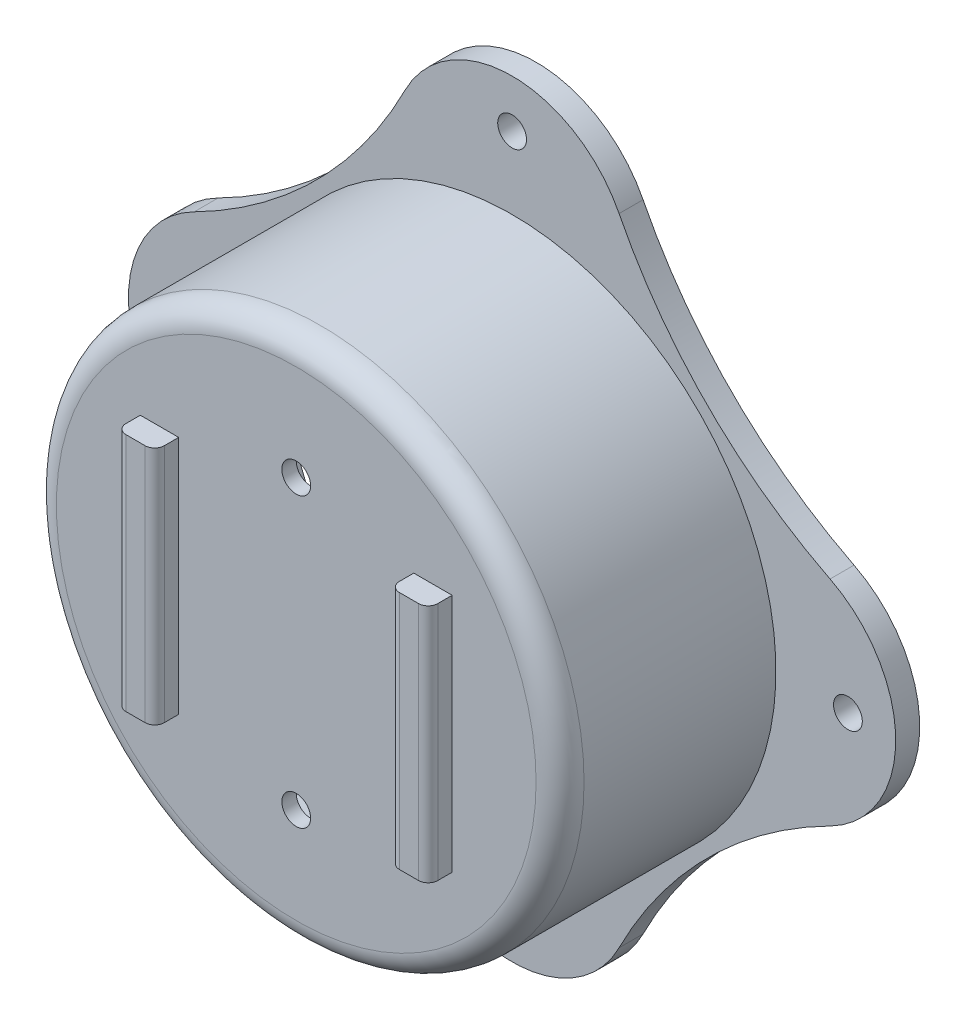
ISO-10303-21;
HEADER;
FILE_DESCRIPTION(('STEP AP214'),'2;1');
FILE_NAME('part.step','',(''),(''),'','','');
FILE_SCHEMA(('AUTOMOTIVE_DESIGN { 1 0 10303 214 1 1 1 1 }'));
ENDSEC;
DATA;
#1=APPLICATION_CONTEXT('core data for automotive mechanical design processes');
#2=APPLICATION_PROTOCOL_DEFINITION('international standard','automotive_design',2000,#1);
#3=PRODUCT_CONTEXT('',#1,'mechanical');
#4=PRODUCT('Part','Part','',(#3));
#5=PRODUCT_RELATED_PRODUCT_CATEGORY('part','',(#4));
#6=PRODUCT_DEFINITION_FORMATION('','',#4);
#7=PRODUCT_DEFINITION_CONTEXT('part definition',#1,'design');
#8=PRODUCT_DEFINITION('design','',#6,#7);
#9=PRODUCT_DEFINITION_SHAPE('','',#8);
#10=(LENGTH_UNIT() NAMED_UNIT(*) SI_UNIT(.MILLI.,.METRE.));
#11=(NAMED_UNIT(*) PLANE_ANGLE_UNIT() SI_UNIT($,.RADIAN.));
#12=(NAMED_UNIT(*) SI_UNIT($,.STERADIAN.) SOLID_ANGLE_UNIT());
#13=UNCERTAINTY_MEASURE_WITH_UNIT(LENGTH_MEASURE(1.E-05),#10,'distance_accuracy_value','');
#14=(GEOMETRIC_REPRESENTATION_CONTEXT(3) GLOBAL_UNCERTAINTY_ASSIGNED_CONTEXT((#13)) GLOBAL_UNIT_ASSIGNED_CONTEXT((#10,
#11,#12)) REPRESENTATION_CONTEXT('',''));
#15=CARTESIAN_POINT('',(0.,0.,0.));
#16=DIRECTION('',(0.,0.,1.));
#17=DIRECTION('',(1.,0.,0.));
#18=AXIS2_PLACEMENT_3D('',#15,#16,#17);
#19=CARTESIAN_POINT('',(0.,0.,50.));
#20=DIRECTION('',(0.,0.,-1.));
#21=DIRECTION('',(-1.,0.,0.));
#22=AXIS2_PLACEMENT_3D('',#19,#20,#21);
#23=CYLINDRICAL_SURFACE('',#22,55.);
#24=CARTESIAN_POINT('',(0.,0.,45.));
#25=DIRECTION('',(0.,0.,1.));
#26=DIRECTION('',(1.,0.,0.));
#27=AXIS2_PLACEMENT_3D('',#24,#25,#26);
#28=CIRCLE('',#27,55.);
#29=CARTESIAN_POINT('',(55.,0.,45.));
#30=VERTEX_POINT('',#29);
#31=EDGE_CURVE('E320',#30,#30,#28,.F.);
#32=ORIENTED_EDGE('',*,*,#31,.T.);
#33=EDGE_LOOP('',(#32));
#34=FACE_BOUND('',#33,.T.);
#35=CARTESIAN_POINT('',(0.,0.,5.));
#36=DIRECTION('',(0.,0.,-1.));
#37=DIRECTION('',(-1.,0.,0.));
#38=AXIS2_PLACEMENT_3D('',#35,#36,#37);
#39=CIRCLE('',#38,55.);
#40=CARTESIAN_POINT('',(-55.,0.,5.));
#41=VERTEX_POINT('',#40);
#42=EDGE_CURVE('E323',#41,#41,#39,.T.);
#43=ORIENTED_EDGE('',*,*,#42,.F.);
#44=EDGE_LOOP('',(#43));
#45=FACE_BOUND('',#44,.T.);
#46=ADVANCED_FACE('F36',(#34,#45),#23,.T.);
#47=CARTESIAN_POINT('',(0.,0.,50.));
#48=DIRECTION('',(0.,0.,1.));
#49=DIRECTION('',(1.,0.,0.));
#50=AXIS2_PLACEMENT_3D('',#47,#48,#49);
#51=PLANE('',#50);
#52=DIRECTION('',(0.,-1.,0.));
#53=VECTOR('',#52,1.);
#54=CARTESIAN_POINT('',(32.5,0.,50.));
#55=LINE('',#54,#53);
#56=CARTESIAN_POINT('',(32.5,25.,50.));
#57=VERTEX_POINT('',#56);
#58=CARTESIAN_POINT('',(32.5,-25.,50.));
#59=VERTEX_POINT('',#58);
#60=EDGE_CURVE('E190',#57,#59,#55,.T.);
#61=ORIENTED_EDGE('',*,*,#60,.T.);
#62=DIRECTION('',(1.,0.,0.));
#63=VECTOR('',#62,1.);
#64=CARTESIAN_POINT('',(0.,-25.,50.));
#65=LINE('',#64,#63);
#66=CARTESIAN_POINT('',(24.5,-25.,50.));
#67=VERTEX_POINT('',#66);
#68=EDGE_CURVE('E204',#67,#59,#65,.T.);
#69=ORIENTED_EDGE('',*,*,#68,.F.);
#70=DIRECTION('',(0.,-1.,0.));
#71=VECTOR('',#70,1.);
#72=CARTESIAN_POINT('',(24.5,0.,50.));
#73=LINE('',#72,#71);
#74=CARTESIAN_POINT('',(24.5,25.,50.));
#75=VERTEX_POINT('',#74);
#76=EDGE_CURVE('E202',#75,#67,#73,.T.);
#77=ORIENTED_EDGE('',*,*,#76,.F.);
#78=DIRECTION('',(1.,0.,0.));
#79=VECTOR('',#78,1.);
#80=CARTESIAN_POINT('',(0.,25.,50.));
#81=LINE('',#80,#79);
#82=EDGE_CURVE('E179',#75,#57,#81,.T.);
#83=ORIENTED_EDGE('',*,*,#82,.T.);
#84=EDGE_LOOP('',(#61,#69,#77,#83));
#85=FACE_BOUND('',#84,.T.);
#86=DIRECTION('',(0.,-1.,0.));
#87=VECTOR('',#86,1.);
#88=CARTESIAN_POINT('',(-24.5,0.,50.));
#89=LINE('',#88,#87);
#90=CARTESIAN_POINT('',(-24.5,25.,50.));
#91=VERTEX_POINT('',#90);
#92=CARTESIAN_POINT('',(-24.5,-25.,50.));
#93=VERTEX_POINT('',#92);
#94=EDGE_CURVE('E186',#91,#93,#89,.T.);
#95=ORIENTED_EDGE('',*,*,#94,.T.);
#96=DIRECTION('',(-1.,0.,0.));
#97=VECTOR('',#96,1.);
#98=CARTESIAN_POINT('',(0.,-25.,50.));
#99=LINE('',#98,#97);
#100=CARTESIAN_POINT('',(-32.5,-25.,50.));
#101=VERTEX_POINT('',#100);
#102=EDGE_CURVE('E218',#93,#101,#99,.T.);
#103=ORIENTED_EDGE('',*,*,#102,.T.);
#104=DIRECTION('',(0.,-1.,0.));
#105=VECTOR('',#104,1.);
#106=CARTESIAN_POINT('',(-32.5,0.,50.));
#107=LINE('',#106,#105);
#108=CARTESIAN_POINT('',(-32.5,25.,50.));
#109=VERTEX_POINT('',#108);
#110=EDGE_CURVE('E227',#109,#101,#107,.T.);
#111=ORIENTED_EDGE('',*,*,#110,.F.);
#112=DIRECTION('',(-1.,0.,0.));
#113=VECTOR('',#112,1.);
#114=CARTESIAN_POINT('',(0.,25.,50.));
#115=LINE('',#114,#113);
#116=EDGE_CURVE('E224',#91,#109,#115,.T.);
#117=ORIENTED_EDGE('',*,*,#116,.F.);
#118=EDGE_LOOP('',(#95,#103,#111,#117));
#119=FACE_BOUND('',#118,.T.);
#120=CARTESIAN_POINT('',(0.,30.,50.));
#121=DIRECTION('',(0.,0.,1.));
#122=DIRECTION('',(1.,0.,0.));
#123=AXIS2_PLACEMENT_3D('',#120,#121,#122);
#124=CIRCLE('',#123,3.);
#125=CARTESIAN_POINT('',(3.,30.,50.));
#126=VERTEX_POINT('',#125);
#127=EDGE_CURVE('E240',#126,#126,#124,.T.);
#128=ORIENTED_EDGE('',*,*,#127,.F.);
#129=EDGE_LOOP('',(#128));
#130=FACE_BOUND('',#129,.T.);
#131=CARTESIAN_POINT('',(0.,-30.,50.));
#132=DIRECTION('',(0.,0.,1.));
#133=DIRECTION('',(1.,0.,0.));
#134=AXIS2_PLACEMENT_3D('',#131,#132,#133);
#135=CIRCLE('',#134,3.);
#136=CARTESIAN_POINT('',(3.,-30.,50.));
#137=VERTEX_POINT('',#136);
#138=EDGE_CURVE('E239',#137,#137,#135,.T.);
#139=ORIENTED_EDGE('',*,*,#138,.F.);
#140=EDGE_LOOP('',(#139));
#141=FACE_BOUND('',#140,.T.);
#142=CARTESIAN_POINT('',(0.,0.,50.));
#143=DIRECTION('',(0.,0.,1.));
#144=DIRECTION('',(1.,0.,0.));
#145=AXIS2_PLACEMENT_3D('',#142,#143,#144);
#146=CIRCLE('',#145,50.);
#147=CARTESIAN_POINT('',(50.,0.,50.));
#148=VERTEX_POINT('',#147);
#149=EDGE_CURVE('E304',#148,#148,#146,.T.);
#150=ORIENTED_EDGE('',*,*,#149,.T.);
#151=EDGE_LOOP('',(#150));
#152=FACE_BOUND('',#151,.T.);
#153=ADVANCED_FACE('F199',(#85,#119,#130,#141,#152),#51,.T.);
#154=CARTESIAN_POINT('',(0.,0.,45.));
#155=DIRECTION('',(0.,0.,1.));
#156=DIRECTION('',(1.,0.,0.));
#157=AXIS2_PLACEMENT_3D('',#154,#155,#156);
#158=TOROIDAL_SURFACE('',#157,50.,5.);
#159=ORIENTED_EDGE('',*,*,#31,.F.);
#160=EDGE_LOOP('',(#159));
#161=FACE_BOUND('',#160,.T.);
#162=ORIENTED_EDGE('',*,*,#149,.F.);
#163=EDGE_LOOP('',(#162));
#164=FACE_BOUND('',#163,.T.);
#165=ADVANCED_FACE('F382',(#161,#164),#158,.T.);
#166=CARTESIAN_POINT('',(-111.488826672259,111.526227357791,5.));
#167=DIRECTION('',(0.,0.,-1.));
#168=DIRECTION('',(-1.,0.,0.));
#169=AXIS2_PLACEMENT_3D('',#166,#167,#168);
#170=CYLINDRICAL_SURFACE('',#169,99.9998914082);
#171=CARTESIAN_POINT('',(-111.488826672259,111.526227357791,0.));
#172=DIRECTION('',(0.,0.,1.));
#173=DIRECTION('',(-1.,0.,0.));
#174=AXIS2_PLACEMENT_3D('',#171,#172,#173);
#175=CIRCLE('',#174,99.9998914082);
#176=CARTESIAN_POINT('',(-66.2765184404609,22.3307932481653,0.));
#177=VERTEX_POINT('',#176);
#178=CARTESIAN_POINT('',(-22.2977847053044,66.3052552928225,0.));
#179=VERTEX_POINT('',#178);
#180=EDGE_CURVE('E249',#177,#179,#175,.T.);
#181=ORIENTED_EDGE('',*,*,#180,.F.);
#182=DIRECTION('',(0.,0.,-1.));
#183=VECTOR('',#182,1.);
#184=CARTESIAN_POINT('',(-66.2765184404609,22.3307932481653,5.));
#185=LINE('',#184,#183);
#186=CARTESIAN_POINT('',(-66.2765184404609,22.3307932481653,5.));
#187=VERTEX_POINT('',#186);
#188=EDGE_CURVE('E302',#187,#177,#185,.T.);
#189=ORIENTED_EDGE('',*,*,#188,.F.);
#190=CARTESIAN_POINT('',(-111.488826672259,111.526227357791,5.));
#191=DIRECTION('',(0.,0.,1.));
#192=DIRECTION('',(-1.,0.,0.));
#193=AXIS2_PLACEMENT_3D('',#190,#191,#192);
#194=CIRCLE('',#193,99.9998914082);
#195=CARTESIAN_POINT('',(-22.2977847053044,66.3052552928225,5.));
#196=VERTEX_POINT('',#195);
#197=EDGE_CURVE('E254',#187,#196,#194,.T.);
#198=ORIENTED_EDGE('',*,*,#197,.T.);
#199=DIRECTION('',(0.,0.,-1.));
#200=VECTOR('',#199,1.);
#201=CARTESIAN_POINT('',(-22.2977847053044,66.3052552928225,5.));
#202=LINE('',#201,#200);
#203=EDGE_CURVE('E279',#196,#179,#202,.T.);
#204=ORIENTED_EDGE('',*,*,#203,.T.);
#205=EDGE_LOOP('',(#181,#189,#198,#204));
#206=FACE_BOUND('',#205,.T.);
#207=ADVANCED_FACE('F391',(#206),#170,.F.);
#208=CARTESIAN_POINT('',(-54.9734291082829,0.0319105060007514,5.));
#209=DIRECTION('',(0.,0.,-1.));
#210=DIRECTION('',(-1.,0.,0.));
#211=AXIS2_PLACEMENT_3D('',#208,#209,#210);
#212=CYLINDRICAL_SURFACE('',#211,24.9999999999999);
#213=CARTESIAN_POINT('',(-54.9734291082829,0.0319105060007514,0.));
#214=DIRECTION('',(0.,0.,-1.));
#215=DIRECTION('',(-1.,0.,0.));
#216=AXIS2_PLACEMENT_3D('',#213,#214,#215);
#217=CIRCLE('',#216,24.9999999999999);
#218=CARTESIAN_POINT('',(-66.2786844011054,-22.2658741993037,0.));
#219=VERTEX_POINT('',#218);
#220=EDGE_CURVE('E258',#219,#177,#217,.T.);
#221=ORIENTED_EDGE('',*,*,#220,.F.);
#222=DIRECTION('',(0.,0.,-1.));
#223=VECTOR('',#222,1.);
#224=CARTESIAN_POINT('',(-66.2786844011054,-22.2658741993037,5.));
#225=LINE('',#224,#223);
#226=CARTESIAN_POINT('',(-66.2786844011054,-22.2658741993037,5.));
#227=VERTEX_POINT('',#226);
#228=EDGE_CURVE('E305',#227,#219,#225,.T.);
#229=ORIENTED_EDGE('',*,*,#228,.F.);
#230=CARTESIAN_POINT('',(-54.9734291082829,0.0319105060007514,5.));
#231=DIRECTION('',(0.,0.,-1.));
#232=DIRECTION('',(-1.,0.,0.));
#233=AXIS2_PLACEMENT_3D('',#230,#231,#232);
#234=CIRCLE('',#233,24.9999999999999);
#235=EDGE_CURVE('E276',#227,#187,#234,.T.);
#236=ORIENTED_EDGE('',*,*,#235,.T.);
#237=ORIENTED_EDGE('',*,*,#188,.T.);
#238=EDGE_LOOP('',(#221,#229,#236,#237));
#239=FACE_BOUND('',#238,.T.);
#240=ADVANCED_FACE('F397',(#239),#212,.T.);
#241=CARTESIAN_POINT('',(-111.499656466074,-111.456916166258,5.));
#242=DIRECTION('',(0.,0.,-1.));
#243=DIRECTION('',(-1.,0.,0.));
#244=AXIS2_PLACEMENT_3D('',#241,#242,#243);
#245=CYLINDRICAL_SURFACE('',#244,99.9998914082);
#246=CARTESIAN_POINT('',(-111.499656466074,-111.456916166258,0.));
#247=DIRECTION('',(0.,0.,1.));
#248=DIRECTION('',(-1.,0.,0.));
#249=AXIS2_PLACEMENT_3D('',#246,#247,#248);
#250=CIRCLE('',#249,99.9998914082);
#251=CARTESIAN_POINT('',(-22.3042223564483,-66.2446079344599,0.));
#252=VERTEX_POINT('',#251);
#253=EDGE_CURVE('E297',#252,#219,#250,.T.);
#254=ORIENTED_EDGE('',*,*,#253,.F.);
#255=DIRECTION('',(0.,0.,-1.));
#256=VECTOR('',#255,1.);
#257=CARTESIAN_POINT('',(-22.3042223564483,-66.2446079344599,5.));
#258=LINE('',#257,#256);
#259=CARTESIAN_POINT('',(-22.3042223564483,-66.2446079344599,5.));
#260=VERTEX_POINT('',#259);
#261=EDGE_CURVE('E307',#260,#252,#258,.T.);
#262=ORIENTED_EDGE('',*,*,#261,.F.);
#263=CARTESIAN_POINT('',(-111.499656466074,-111.456916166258,5.));
#264=DIRECTION('',(0.,0.,1.));
#265=DIRECTION('',(-1.,0.,0.));
#266=AXIS2_PLACEMENT_3D('',#263,#264,#265);
#267=CIRCLE('',#266,99.9998914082);
#268=EDGE_CURVE('E273',#260,#227,#267,.T.);
#269=ORIENTED_EDGE('',*,*,#268,.T.);
#270=ORIENTED_EDGE('',*,*,#228,.T.);
#271=EDGE_LOOP('',(#254,#262,#269,#270));
#272=FACE_BOUND('',#271,.T.);
#273=ADVANCED_FACE('F434',(#272),#245,.F.);
#274=CARTESIAN_POINT('',(-0.00533961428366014,-54.9415186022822,5.));
#275=DIRECTION('',(0.,0.,-1.));
#276=DIRECTION('',(-1.,0.,0.));
#277=AXIS2_PLACEMENT_3D('',#274,#275,#276);
#278=CYLINDRICAL_SURFACE('',#277,25.0000000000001);
#279=CARTESIAN_POINT('',(-0.00533961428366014,-54.9415186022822,0.));
#280=DIRECTION('',(0.,0.,-1.));
#281=DIRECTION('',(-1.,0.,0.));
#282=AXIS2_PLACEMENT_3D('',#279,#280,#281);
#283=CIRCLE('',#282,25.0000000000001);
#284=CARTESIAN_POINT('',(22.2924450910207,-66.2467738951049,0.));
#285=VERTEX_POINT('',#284);
#286=EDGE_CURVE('E294',#285,#252,#283,.T.);
#287=ORIENTED_EDGE('',*,*,#286,.F.);
#288=DIRECTION('',(0.,0.,-1.));
#289=VECTOR('',#288,1.);
#290=CARTESIAN_POINT('',(22.2924450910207,-66.2467738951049,5.));
#291=LINE('',#290,#289);
#292=CARTESIAN_POINT('',(22.2924450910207,-66.2467738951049,5.));
#293=VERTEX_POINT('',#292);
#294=EDGE_CURVE('E309',#293,#285,#291,.T.);
#295=ORIENTED_EDGE('',*,*,#294,.F.);
#296=CARTESIAN_POINT('',(-0.00533961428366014,-54.9415186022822,5.));
#297=DIRECTION('',(0.,0.,-1.));
#298=DIRECTION('',(-1.,0.,0.));
#299=AXIS2_PLACEMENT_3D('',#296,#297,#298);
#300=CIRCLE('',#299,25.0000000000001);
#301=EDGE_CURVE('E270',#293,#260,#300,.T.);
#302=ORIENTED_EDGE('',*,*,#301,.T.);
#303=ORIENTED_EDGE('',*,*,#261,.T.);
#304=EDGE_LOOP('',(#287,#295,#302,#303));
#305=FACE_BOUND('',#304,.T.);
#306=ADVANCED_FACE('F430',(#305),#278,.T.);
#307=CARTESIAN_POINT('',(111.483487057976,-111.467745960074,5.));
#308=DIRECTION('',(0.,0.,-1.));
#309=DIRECTION('',(-1.,0.,0.));
#310=AXIS2_PLACEMENT_3D('',#307,#308,#309);
#311=CYLINDRICAL_SURFACE('',#310,99.9998914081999);
#312=CARTESIAN_POINT('',(111.483487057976,-111.467745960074,0.));
#313=DIRECTION('',(0.,0.,1.));
#314=DIRECTION('',(-1.,0.,0.));
#315=AXIS2_PLACEMENT_3D('',#312,#313,#314);
#316=CIRCLE('',#315,99.9998914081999);
#317=CARTESIAN_POINT('',(66.2711788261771,-22.2723118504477,0.));
#318=VERTEX_POINT('',#317);
#319=EDGE_CURVE('E291',#318,#285,#316,.T.);
#320=ORIENTED_EDGE('',*,*,#319,.F.);
#321=DIRECTION('',(0.,0.,-1.));
#322=VECTOR('',#321,1.);
#323=CARTESIAN_POINT('',(66.2711788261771,-22.2723118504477,5.));
#324=LINE('',#323,#322);
#325=CARTESIAN_POINT('',(66.2711788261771,-22.2723118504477,5.));
#326=VERTEX_POINT('',#325);
#327=EDGE_CURVE('E311',#326,#318,#324,.T.);
#328=ORIENTED_EDGE('',*,*,#327,.F.);
#329=CARTESIAN_POINT('',(111.483487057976,-111.467745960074,5.));
#330=DIRECTION('',(0.,0.,1.));
#331=DIRECTION('',(-1.,0.,0.));
#332=AXIS2_PLACEMENT_3D('',#329,#330,#331);
#333=CIRCLE('',#332,99.9998914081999);
#334=EDGE_CURVE('E267',#326,#293,#333,.T.);
#335=ORIENTED_EDGE('',*,*,#334,.T.);
#336=ORIENTED_EDGE('',*,*,#294,.T.);
#337=EDGE_LOOP('',(#320,#328,#335,#336));
#338=FACE_BOUND('',#337,.T.);
#339=ADVANCED_FACE('F426',(#338),#311,.F.);
#340=CARTESIAN_POINT('',(54.9680894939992,0.026570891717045,5.));
#341=DIRECTION('',(0.,0.,-1.));
#342=DIRECTION('',(-1.,0.,0.));
#343=AXIS2_PLACEMENT_3D('',#340,#341,#342);
#344=CYLINDRICAL_SURFACE('',#343,25.);
#345=CARTESIAN_POINT('',(54.9680894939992,0.026570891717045,0.));
#346=DIRECTION('',(0.,0.,-1.));
#347=DIRECTION('',(-1.,0.,0.));
#348=AXIS2_PLACEMENT_3D('',#345,#346,#347);
#349=CIRCLE('',#348,25.);
#350=CARTESIAN_POINT('',(66.2733447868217,22.3243555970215,0.));
#351=VERTEX_POINT('',#350);
#352=EDGE_CURVE('E288',#351,#318,#349,.T.);
#353=ORIENTED_EDGE('',*,*,#352,.F.);
#354=DIRECTION('',(0.,0.,-1.));
#355=VECTOR('',#354,1.);
#356=CARTESIAN_POINT('',(66.2733447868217,22.3243555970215,5.));
#357=LINE('',#356,#355);
#358=CARTESIAN_POINT('',(66.2733447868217,22.3243555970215,5.));
#359=VERTEX_POINT('',#358);
#360=EDGE_CURVE('E313',#359,#351,#357,.T.);
#361=ORIENTED_EDGE('',*,*,#360,.F.);
#362=CARTESIAN_POINT('',(54.9680894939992,0.026570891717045,5.));
#363=DIRECTION('',(0.,0.,-1.));
#364=DIRECTION('',(-1.,0.,0.));
#365=AXIS2_PLACEMENT_3D('',#362,#363,#364);
#366=CIRCLE('',#365,25.);
#367=EDGE_CURVE('E264',#359,#326,#366,.T.);
#368=ORIENTED_EDGE('',*,*,#367,.T.);
#369=ORIENTED_EDGE('',*,*,#327,.T.);
#370=EDGE_LOOP('',(#353,#361,#368,#369));
#371=FACE_BOUND('',#370,.T.);
#372=ADVANCED_FACE('F422',(#371),#344,.T.);
#373=CARTESIAN_POINT('',(111.494316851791,111.515397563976,5.));
#374=DIRECTION('',(0.,0.,-1.));
#375=DIRECTION('',(-1.,0.,0.));
#376=AXIS2_PLACEMENT_3D('',#373,#374,#375);
#377=CYLINDRICAL_SURFACE('',#376,99.9998914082);
#378=CARTESIAN_POINT('',(111.494316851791,111.515397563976,0.));
#379=DIRECTION('',(0.,0.,1.));
#380=DIRECTION('',(-1.,0.,0.));
#381=AXIS2_PLACEMENT_3D('',#378,#379,#380);
#382=CIRCLE('',#381,99.9998914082);
#383=CARTESIAN_POINT('',(22.2988827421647,66.3030893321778,0.));
#384=VERTEX_POINT('',#383);
#385=EDGE_CURVE('E285',#384,#351,#382,.T.);
#386=ORIENTED_EDGE('',*,*,#385,.F.);
#387=DIRECTION('',(0.,0.,-1.));
#388=VECTOR('',#387,1.);
#389=CARTESIAN_POINT('',(22.2988827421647,66.3030893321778,5.));
#390=LINE('',#389,#388);
#391=CARTESIAN_POINT('',(22.2988827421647,66.3030893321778,5.));
#392=VERTEX_POINT('',#391);
#393=EDGE_CURVE('E315',#392,#384,#390,.T.);
#394=ORIENTED_EDGE('',*,*,#393,.F.);
#395=CARTESIAN_POINT('',(111.494316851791,111.515397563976,5.));
#396=DIRECTION('',(0.,0.,1.));
#397=DIRECTION('',(-1.,0.,0.));
#398=AXIS2_PLACEMENT_3D('',#395,#396,#397);
#399=CIRCLE('',#398,99.9998914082);
#400=EDGE_CURVE('E261',#392,#359,#399,.T.);
#401=ORIENTED_EDGE('',*,*,#400,.T.);
#402=ORIENTED_EDGE('',*,*,#360,.T.);
#403=EDGE_LOOP('',(#386,#394,#401,#402));
#404=FACE_BOUND('',#403,.T.);
#405=ADVANCED_FACE('F418',(#404),#377,.F.);
#406=CARTESIAN_POINT('',(0.,55.,5.));
#407=DIRECTION('',(0.,0.,-1.));
#408=DIRECTION('',(-1.,0.,0.));
#409=AXIS2_PLACEMENT_3D('',#406,#407,#408);
#410=CYLINDRICAL_SURFACE('',#409,25.);
#411=CARTESIAN_POINT('',(0.,55.,0.));
#412=DIRECTION('',(0.,0.,-1.));
#413=DIRECTION('',(-1.,0.,0.));
#414=AXIS2_PLACEMENT_3D('',#411,#412,#413);
#415=CIRCLE('',#414,25.);
#416=EDGE_CURVE('E282',#179,#384,#415,.T.);
#417=ORIENTED_EDGE('',*,*,#416,.F.);
#418=ORIENTED_EDGE('',*,*,#203,.F.);
#419=CARTESIAN_POINT('',(0.,55.,5.));
#420=DIRECTION('',(0.,0.,-1.));
#421=DIRECTION('',(-1.,0.,0.));
#422=AXIS2_PLACEMENT_3D('',#419,#420,#421);
#423=CIRCLE('',#422,25.);
#424=EDGE_CURVE('E257',#196,#392,#423,.T.);
#425=ORIENTED_EDGE('',*,*,#424,.T.);
#426=ORIENTED_EDGE('',*,*,#393,.T.);
#427=EDGE_LOOP('',(#417,#418,#425,#426));
#428=FACE_BOUND('',#427,.T.);
#429=ADVANCED_FACE('F415',(#428),#410,.T.);
#430=CARTESIAN_POINT('',(-83.231127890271,55.7790689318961,5.));
#431=DIRECTION('',(0.,0.,-1.));
#432=DIRECTION('',(-1.,0.,0.));
#433=AXIS2_PLACEMENT_3D('',#430,#431,#432);
#434=PLANE('',#433);
#435=CARTESIAN_POINT('',(70.,0.,5.));
#436=DIRECTION('',(0.,0.,1.));
#437=DIRECTION('',(1.,0.,0.));
#438=AXIS2_PLACEMENT_3D('',#435,#436,#437);
#439=CIRCLE('',#438,2.99999999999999);
#440=CARTESIAN_POINT('',(73.,0.,5.));
#441=VERTEX_POINT('',#440);
#442=EDGE_CURVE('E509',#441,#441,#439,.T.);
#443=ORIENTED_EDGE('',*,*,#442,.F.);
#444=EDGE_LOOP('',(#443));
#445=FACE_BOUND('',#444,.T.);
#446=CARTESIAN_POINT('',(-2.44403693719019E-13,-70.,5.));
#447=DIRECTION('',(0.,0.,1.));
#448=DIRECTION('',(1.,0.,0.));
#449=AXIS2_PLACEMENT_3D('',#446,#447,#448);
#450=CIRCLE('',#449,2.99999999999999);
#451=CARTESIAN_POINT('',(2.99999999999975,-70.,5.));
#452=VERTEX_POINT('',#451);
#453=EDGE_CURVE('E514',#452,#452,#450,.T.);
#454=ORIENTED_EDGE('',*,*,#453,.F.);
#455=EDGE_LOOP('',(#454));
#456=FACE_BOUND('',#455,.T.);
#457=CARTESIAN_POINT('',(-70.,4.88807387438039E-13,5.));
#458=DIRECTION('',(0.,0.,1.));
#459=DIRECTION('',(1.,0.,0.));
#460=AXIS2_PLACEMENT_3D('',#457,#458,#459);
#461=CIRCLE('',#460,2.99999999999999);
#462=CARTESIAN_POINT('',(-67.,4.88807387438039E-13,5.));
#463=VERTEX_POINT('',#462);
#464=EDGE_CURVE('E522',#463,#463,#461,.T.);
#465=ORIENTED_EDGE('',*,*,#464,.F.);
#466=EDGE_LOOP('',(#465));
#467=FACE_BOUND('',#466,.T.);
#468=CARTESIAN_POINT('',(7.33211081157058E-13,70.,5.));
#469=DIRECTION('',(0.,0.,1.));
#470=DIRECTION('',(1.,0.,0.));
#471=AXIS2_PLACEMENT_3D('',#468,#469,#470);
#472=CIRCLE('',#471,3.);
#473=CARTESIAN_POINT('',(3.00000000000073,70.,5.));
#474=VERTEX_POINT('',#473);
#475=EDGE_CURVE('E528',#474,#474,#472,.T.);
#476=ORIENTED_EDGE('',*,*,#475,.F.);
#477=EDGE_LOOP('',(#476));
#478=FACE_BOUND('',#477,.T.);
#479=ORIENTED_EDGE('',*,*,#42,.T.);
#480=EDGE_LOOP('',(#479));
#481=FACE_BOUND('',#480,.T.);
#482=ORIENTED_EDGE('',*,*,#197,.F.);
#483=ORIENTED_EDGE('',*,*,#235,.F.);
#484=ORIENTED_EDGE('',*,*,#268,.F.);
#485=ORIENTED_EDGE('',*,*,#301,.F.);
#486=ORIENTED_EDGE('',*,*,#334,.F.);
#487=ORIENTED_EDGE('',*,*,#367,.F.);
#488=ORIENTED_EDGE('',*,*,#400,.F.);
#489=ORIENTED_EDGE('',*,*,#424,.F.);
#490=EDGE_LOOP('',(#482,#483,#484,#485,#486,#487,#488,#489));
#491=FACE_BOUND('',#490,.T.);
#492=ADVANCED_FACE('F412',(#445,#456,#467,#478,#481,#491),#434,.F.);
#493=CARTESIAN_POINT('',(0.,0.,0.));
#494=DIRECTION('',(0.,0.,1.));
#495=DIRECTION('',(1.,0.,0.));
#496=AXIS2_PLACEMENT_3D('',#493,#494,#495);
#497=PLANE('',#496);
#498=CARTESIAN_POINT('',(70.,0.,0.));
#499=DIRECTION('',(0.,0.,1.));
#500=DIRECTION('',(1.,0.,0.));
#501=AXIS2_PLACEMENT_3D('',#498,#499,#500);
#502=CIRCLE('',#501,2.99999999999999);
#503=CARTESIAN_POINT('',(73.,0.,0.));
#504=VERTEX_POINT('',#503);
#505=EDGE_CURVE('E197',#504,#504,#502,.T.);
#506=ORIENTED_EDGE('',*,*,#505,.T.);
#507=EDGE_LOOP('',(#506));
#508=FACE_BOUND('',#507,.T.);
#509=CARTESIAN_POINT('',(-2.44403693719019E-13,-70.,0.));
#510=DIRECTION('',(0.,0.,1.));
#511=DIRECTION('',(1.,0.,0.));
#512=AXIS2_PLACEMENT_3D('',#509,#510,#511);
#513=CIRCLE('',#512,2.99999999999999);
#514=CARTESIAN_POINT('',(2.99999999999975,-70.,0.));
#515=VERTEX_POINT('',#514);
#516=EDGE_CURVE('E510',#515,#515,#513,.T.);
#517=ORIENTED_EDGE('',*,*,#516,.T.);
#518=EDGE_LOOP('',(#517));
#519=FACE_BOUND('',#518,.T.);
#520=CARTESIAN_POINT('',(-70.,4.88807387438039E-13,0.));
#521=DIRECTION('',(0.,0.,1.));
#522=DIRECTION('',(1.,0.,0.));
#523=AXIS2_PLACEMENT_3D('',#520,#521,#522);
#524=CIRCLE('',#523,2.99999999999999);
#525=CARTESIAN_POINT('',(-67.,4.88807387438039E-13,0.));
#526=VERTEX_POINT('',#525);
#527=EDGE_CURVE('E519',#526,#526,#524,.T.);
#528=ORIENTED_EDGE('',*,*,#527,.T.);
#529=EDGE_LOOP('',(#528));
#530=FACE_BOUND('',#529,.T.);
#531=CARTESIAN_POINT('',(7.33211081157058E-13,70.,0.));
#532=DIRECTION('',(0.,0.,1.));
#533=DIRECTION('',(1.,0.,0.));
#534=AXIS2_PLACEMENT_3D('',#531,#532,#533);
#535=CIRCLE('',#534,3.);
#536=CARTESIAN_POINT('',(3.00000000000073,70.,0.));
#537=VERTEX_POINT('',#536);
#538=EDGE_CURVE('E525',#537,#537,#535,.T.);
#539=ORIENTED_EDGE('',*,*,#538,.T.);
#540=EDGE_LOOP('',(#539));
#541=FACE_BOUND('',#540,.T.);
#542=CARTESIAN_POINT('',(0.,0.,0.));
#543=DIRECTION('',(0.,0.,-1.));
#544=DIRECTION('',(-1.,0.,0.));
#545=AXIS2_PLACEMENT_3D('',#542,#543,#544);
#546=CIRCLE('',#545,52.);
#547=CARTESIAN_POINT('',(-52.,0.,0.));
#548=VERTEX_POINT('',#547);
#549=EDGE_CURVE('E250',#548,#548,#546,.T.);
#550=ORIENTED_EDGE('',*,*,#549,.F.);
#551=EDGE_LOOP('',(#550));
#552=FACE_BOUND('',#551,.T.);
#553=ORIENTED_EDGE('',*,*,#180,.T.);
#554=ORIENTED_EDGE('',*,*,#416,.T.);
#555=ORIENTED_EDGE('',*,*,#385,.T.);
#556=ORIENTED_EDGE('',*,*,#352,.T.);
#557=ORIENTED_EDGE('',*,*,#319,.T.);
#558=ORIENTED_EDGE('',*,*,#286,.T.);
#559=ORIENTED_EDGE('',*,*,#253,.T.);
#560=ORIENTED_EDGE('',*,*,#220,.T.);
#561=EDGE_LOOP('',(#553,#554,#555,#556,#557,#558,#559,#560));
#562=FACE_BOUND('',#561,.T.);
#563=ADVANCED_FACE('F409',(#508,#519,#530,#541,#552,#562),#497,.F.);
#564=CARTESIAN_POINT('',(0.,0.,47.));
#565=DIRECTION('',(0.,0.,-1.));
#566=DIRECTION('',(-1.,0.,0.));
#567=AXIS2_PLACEMENT_3D('',#564,#565,#566);
#568=CYLINDRICAL_SURFACE('',#567,52.);
#569=CARTESIAN_POINT('',(0.,0.,47.));
#570=DIRECTION('',(0.,0.,-1.));
#571=DIRECTION('',(-1.,0.,0.));
#572=AXIS2_PLACEMENT_3D('',#569,#570,#571);
#573=CIRCLE('',#572,52.);
#574=CARTESIAN_POINT('',(-52.,0.,47.));
#575=VERTEX_POINT('',#574);
#576=EDGE_CURVE('E246',#575,#575,#573,.T.);
#577=ORIENTED_EDGE('',*,*,#576,.F.);
#578=EDGE_LOOP('',(#577));
#579=FACE_BOUND('',#578,.T.);
#580=ORIENTED_EDGE('',*,*,#549,.T.);
#581=EDGE_LOOP('',(#580));
#582=FACE_BOUND('',#581,.T.);
#583=ADVANCED_FACE('F411',(#579,#582),#568,.F.);
#584=CARTESIAN_POINT('',(0.,0.,47.));
#585=DIRECTION('',(0.,0.,-1.));
#586=DIRECTION('',(-1.,0.,0.));
#587=AXIS2_PLACEMENT_3D('',#584,#585,#586);
#588=PLANE('',#587);
#589=CARTESIAN_POINT('',(0.,30.,47.));
#590=DIRECTION('',(0.,0.,-1.));
#591=DIRECTION('',(-1.,0.,0.));
#592=AXIS2_PLACEMENT_3D('',#589,#590,#591);
#593=CIRCLE('',#592,3.);
#594=CARTESIAN_POINT('',(-3.,30.,47.));
#595=VERTEX_POINT('',#594);
#596=EDGE_CURVE('E253',#595,#595,#593,.T.);
#597=ORIENTED_EDGE('',*,*,#596,.F.);
#598=EDGE_LOOP('',(#597));
#599=FACE_BOUND('',#598,.T.);
#600=CARTESIAN_POINT('',(0.,-30.,47.));
#601=DIRECTION('',(0.,0.,-1.));
#602=DIRECTION('',(-1.,0.,0.));
#603=AXIS2_PLACEMENT_3D('',#600,#601,#602);
#604=CIRCLE('',#603,3.);
#605=CARTESIAN_POINT('',(-3.,-30.,47.));
#606=VERTEX_POINT('',#605);
#607=EDGE_CURVE('E243',#606,#606,#604,.T.);
#608=ORIENTED_EDGE('',*,*,#607,.F.);
#609=EDGE_LOOP('',(#608));
#610=FACE_BOUND('',#609,.T.);
#611=ORIENTED_EDGE('',*,*,#576,.T.);
#612=EDGE_LOOP('',(#611));
#613=FACE_BOUND('',#612,.T.);
#614=ADVANCED_FACE('F447',(#599,#610,#613),#588,.T.);
#615=CARTESIAN_POINT('',(0.,-30.,3.));
#616=DIRECTION('',(0.,0.,1.));
#617=DIRECTION('',(1.,0.,0.));
#618=AXIS2_PLACEMENT_3D('',#615,#616,#617);
#619=CYLINDRICAL_SURFACE('',#618,3.);
#620=ORIENTED_EDGE('',*,*,#607,.T.);
#621=EDGE_LOOP('',(#620));
#622=FACE_BOUND('',#621,.T.);
#623=ORIENTED_EDGE('',*,*,#138,.T.);
#624=EDGE_LOOP('',(#623));
#625=FACE_BOUND('',#624,.T.);
#626=ADVANCED_FACE('F451',(#622,#625),#619,.F.);
#627=CARTESIAN_POINT('',(0.,30.,3.));
#628=DIRECTION('',(0.,0.,1.));
#629=DIRECTION('',(1.,0.,0.));
#630=AXIS2_PLACEMENT_3D('',#627,#628,#629);
#631=CYLINDRICAL_SURFACE('',#630,3.);
#632=ORIENTED_EDGE('',*,*,#596,.T.);
#633=EDGE_LOOP('',(#632));
#634=FACE_BOUND('',#633,.T.);
#635=ORIENTED_EDGE('',*,*,#127,.T.);
#636=EDGE_LOOP('',(#635));
#637=FACE_BOUND('',#636,.T.);
#638=ADVANCED_FACE('F455',(#634,#637),#631,.F.);
#639=CARTESIAN_POINT('',(-24.5,0.,55.));
#640=DIRECTION('',(1.,0.,0.));
#641=DIRECTION('',(0.,0.,-1.));
#642=AXIS2_PLACEMENT_3D('',#639,#640,#641);
#643=PLANE('',#642);
#644=DIRECTION('',(0.,0.,-1.));
#645=VECTOR('',#644,1.);
#646=CARTESIAN_POINT('',(-24.5,25.,55.));
#647=LINE('',#646,#645);
#648=CARTESIAN_POINT('',(-24.5,25.,53.));
#649=VERTEX_POINT('',#648);
#650=EDGE_CURVE('E237',#649,#91,#647,.T.);
#651=ORIENTED_EDGE('',*,*,#650,.F.);
#652=DIRECTION('',(0.,-1.,0.));
#653=VECTOR('',#652,1.);
#654=CARTESIAN_POINT('',(-24.5,0.,53.));
#655=LINE('',#654,#653);
#656=CARTESIAN_POINT('',(-24.5,-25.,53.));
#657=VERTEX_POINT('',#656);
#658=EDGE_CURVE('E346',#649,#657,#655,.T.);
#659=ORIENTED_EDGE('',*,*,#658,.T.);
#660=DIRECTION('',(0.,0.,-1.));
#661=VECTOR('',#660,1.);
#662=CARTESIAN_POINT('',(-24.5,-25.,55.));
#663=LINE('',#662,#661);
#664=EDGE_CURVE('E221',#657,#93,#663,.T.);
#665=ORIENTED_EDGE('',*,*,#664,.T.);
#666=ORIENTED_EDGE('',*,*,#94,.F.);
#667=EDGE_LOOP('',(#651,#659,#665,#666));
#668=FACE_BOUND('',#667,.T.);
#669=ADVANCED_FACE('F367',(#668),#643,.T.);
#670=CARTESIAN_POINT('',(0.,25.,55.));
#671=DIRECTION('',(0.,-1.,0.));
#672=DIRECTION('',(0.,0.,-1.));
#673=AXIS2_PLACEMENT_3D('',#670,#671,#672);
#674=PLANE('',#673);
#675=DIRECTION('',(-1.,0.,0.));
#676=VECTOR('',#675,1.);
#677=CARTESIAN_POINT('',(0.,25.,55.));
#678=LINE('',#677,#676);
#679=CARTESIAN_POINT('',(-26.5,25.,55.));
#680=VERTEX_POINT('',#679);
#681=CARTESIAN_POINT('',(-30.5,25.,55.));
#682=VERTEX_POINT('',#681);
#683=EDGE_CURVE('E215',#680,#682,#678,.T.);
#684=ORIENTED_EDGE('',*,*,#683,.F.);
#685=CARTESIAN_POINT('',(-26.5,25.,53.));
#686=DIRECTION('',(0.,-1.,0.));
#687=DIRECTION('',(0.,0.,-1.));
#688=AXIS2_PLACEMENT_3D('',#685,#686,#687);
#689=CIRCLE('',#688,2.);
#690=EDGE_CURVE('E44',#680,#649,#689,.F.);
#691=ORIENTED_EDGE('',*,*,#690,.T.);
#692=ORIENTED_EDGE('',*,*,#650,.T.);
#693=ORIENTED_EDGE('',*,*,#116,.T.);
#694=DIRECTION('',(0.,0.,-1.));
#695=VECTOR('',#694,1.);
#696=CARTESIAN_POINT('',(-32.5,25.,55.));
#697=LINE('',#696,#695);
#698=CARTESIAN_POINT('',(-32.5,25.,53.));
#699=VERTEX_POINT('',#698);
#700=EDGE_CURVE('E235',#699,#109,#697,.T.);
#701=ORIENTED_EDGE('',*,*,#700,.F.);
#702=CARTESIAN_POINT('',(-30.5,25.,53.));
#703=DIRECTION('',(0.,-1.,0.));
#704=DIRECTION('',(0.,0.,-1.));
#705=AXIS2_PLACEMENT_3D('',#702,#703,#704);
#706=CIRCLE('',#705,2.);
#707=EDGE_CURVE('E56',#699,#682,#706,.F.);
#708=ORIENTED_EDGE('',*,*,#707,.T.);
#709=EDGE_LOOP('',(#684,#691,#692,#693,#701,#708));
#710=FACE_BOUND('',#709,.T.);
#711=ADVANCED_FACE('F360',(#710),#674,.F.);
#712=CARTESIAN_POINT('',(-32.5,0.,55.));
#713=DIRECTION('',(1.,0.,0.));
#714=DIRECTION('',(0.,0.,-1.));
#715=AXIS2_PLACEMENT_3D('',#712,#713,#714);
#716=PLANE('',#715);
#717=DIRECTION('',(0.,0.,-1.));
#718=VECTOR('',#717,1.);
#719=CARTESIAN_POINT('',(-32.5,-25.,55.));
#720=LINE('',#719,#718);
#721=CARTESIAN_POINT('',(-32.5,-25.,53.));
#722=VERTEX_POINT('',#721);
#723=EDGE_CURVE('E233',#722,#101,#720,.T.);
#724=ORIENTED_EDGE('',*,*,#723,.F.);
#725=DIRECTION('',(0.,-1.,0.));
#726=VECTOR('',#725,1.);
#727=CARTESIAN_POINT('',(-32.5,25.,53.));
#728=LINE('',#727,#726);
#729=EDGE_CURVE('E11',#722,#699,#728,.F.);
#730=ORIENTED_EDGE('',*,*,#729,.T.);
#731=ORIENTED_EDGE('',*,*,#700,.T.);
#732=ORIENTED_EDGE('',*,*,#110,.T.);
#733=EDGE_LOOP('',(#724,#730,#731,#732));
#734=FACE_BOUND('',#733,.T.);
#735=ADVANCED_FACE('F378',(#734),#716,.F.);
#736=CARTESIAN_POINT('',(0.,-25.,55.));
#737=DIRECTION('',(0.,-1.,0.));
#738=DIRECTION('',(0.,0.,-1.));
#739=AXIS2_PLACEMENT_3D('',#736,#737,#738);
#740=PLANE('',#739);
#741=ORIENTED_EDGE('',*,*,#664,.F.);
#742=CARTESIAN_POINT('',(-26.5,-25.,53.));
#743=DIRECTION('',(0.,-1.,0.));
#744=DIRECTION('',(0.,0.,-1.));
#745=AXIS2_PLACEMENT_3D('',#742,#743,#744);
#746=CIRCLE('',#745,2.);
#747=CARTESIAN_POINT('',(-26.5,-25.,55.));
#748=VERTEX_POINT('',#747);
#749=EDGE_CURVE('E351',#657,#748,#746,.T.);
#750=ORIENTED_EDGE('',*,*,#749,.T.);
#751=DIRECTION('',(-1.,0.,0.));
#752=VECTOR('',#751,1.);
#753=CARTESIAN_POINT('',(0.,-25.,55.));
#754=LINE('',#753,#752);
#755=CARTESIAN_POINT('',(-30.5,-25.,55.));
#756=VERTEX_POINT('',#755);
#757=EDGE_CURVE('E217',#748,#756,#754,.T.);
#758=ORIENTED_EDGE('',*,*,#757,.T.);
#759=CARTESIAN_POINT('',(-30.5,-25.,53.));
#760=DIRECTION('',(0.,-1.,0.));
#761=DIRECTION('',(0.,0.,-1.));
#762=AXIS2_PLACEMENT_3D('',#759,#760,#761);
#763=CIRCLE('',#762,2.);
#764=EDGE_CURVE('E349',#756,#722,#763,.T.);
#765=ORIENTED_EDGE('',*,*,#764,.T.);
#766=ORIENTED_EDGE('',*,*,#723,.T.);
#767=ORIENTED_EDGE('',*,*,#102,.F.);
#768=EDGE_LOOP('',(#741,#750,#758,#765,#766,#767));
#769=FACE_BOUND('',#768,.T.);
#770=ADVANCED_FACE('F372',(#769),#740,.T.);
#771=CARTESIAN_POINT('',(0.,0.,55.));
#772=DIRECTION('',(0.,0.,1.));
#773=DIRECTION('',(1.,0.,0.));
#774=AXIS2_PLACEMENT_3D('',#771,#772,#773);
#775=PLANE('',#774);
#776=ORIENTED_EDGE('',*,*,#757,.F.);
#777=DIRECTION('',(0.,-1.,0.));
#778=VECTOR('',#777,1.);
#779=CARTESIAN_POINT('',(-26.5,0.,55.));
#780=LINE('',#779,#778);
#781=EDGE_CURVE('E356',#748,#680,#780,.F.);
#782=ORIENTED_EDGE('',*,*,#781,.T.);
#783=ORIENTED_EDGE('',*,*,#683,.T.);
#784=DIRECTION('',(0.,-1.,0.));
#785=VECTOR('',#784,1.);
#786=CARTESIAN_POINT('',(-30.5,-25.,55.));
#787=LINE('',#786,#785);
#788=EDGE_CURVE('E353',#682,#756,#787,.T.);
#789=ORIENTED_EDGE('',*,*,#788,.T.);
#790=EDGE_LOOP('',(#776,#782,#783,#789));
#791=FACE_BOUND('',#790,.T.);
#792=ADVANCED_FACE('F375',(#791),#775,.T.);
#793=CARTESIAN_POINT('',(32.5,0.,55.));
#794=DIRECTION('',(1.,0.,0.));
#795=DIRECTION('',(0.,0.,-1.));
#796=AXIS2_PLACEMENT_3D('',#793,#794,#795);
#797=PLANE('',#796);
#798=DIRECTION('',(0.,0.,-1.));
#799=VECTOR('',#798,1.);
#800=CARTESIAN_POINT('',(32.5,25.,55.));
#801=LINE('',#800,#799);
#802=CARTESIAN_POINT('',(32.5,25.,53.));
#803=VERTEX_POINT('',#802);
#804=EDGE_CURVE('E173',#803,#57,#801,.T.);
#805=ORIENTED_EDGE('',*,*,#804,.F.);
#806=DIRECTION('',(0.,-1.,0.));
#807=VECTOR('',#806,1.);
#808=CARTESIAN_POINT('',(32.5,0.,53.));
#809=LINE('',#808,#807);
#810=CARTESIAN_POINT('',(32.5,-25.,53.));
#811=VERTEX_POINT('',#810);
#812=EDGE_CURVE('E326',#803,#811,#809,.T.);
#813=ORIENTED_EDGE('',*,*,#812,.T.);
#814=DIRECTION('',(0.,0.,-1.));
#815=VECTOR('',#814,1.);
#816=CARTESIAN_POINT('',(32.5,-25.,55.));
#817=LINE('',#816,#815);
#818=EDGE_CURVE('E193',#811,#59,#817,.T.);
#819=ORIENTED_EDGE('',*,*,#818,.T.);
#820=ORIENTED_EDGE('',*,*,#60,.F.);
#821=EDGE_LOOP('',(#805,#813,#819,#820));
#822=FACE_BOUND('',#821,.T.);
#823=ADVANCED_FACE('F191',(#822),#797,.T.);
#824=CARTESIAN_POINT('',(0.,25.,55.));
#825=DIRECTION('',(0.,1.,0.));
#826=DIRECTION('',(0.,0.,1.));
#827=AXIS2_PLACEMENT_3D('',#824,#825,#826);
#828=PLANE('',#827);
#829=DIRECTION('',(1.,0.,0.));
#830=VECTOR('',#829,1.);
#831=CARTESIAN_POINT('',(0.,25.,55.));
#832=LINE('',#831,#830);
#833=CARTESIAN_POINT('',(26.5,25.,55.));
#834=VERTEX_POINT('',#833);
#835=CARTESIAN_POINT('',(30.5,25.,55.));
#836=VERTEX_POINT('',#835);
#837=EDGE_CURVE('E209',#834,#836,#832,.T.);
#838=ORIENTED_EDGE('',*,*,#837,.T.);
#839=CARTESIAN_POINT('',(30.5,25.,53.));
#840=DIRECTION('',(0.,1.,0.));
#841=DIRECTION('',(0.,0.,1.));
#842=AXIS2_PLACEMENT_3D('',#839,#840,#841);
#843=CIRCLE('',#842,2.);
#844=EDGE_CURVE('E182',#836,#803,#843,.T.);
#845=ORIENTED_EDGE('',*,*,#844,.T.);
#846=ORIENTED_EDGE('',*,*,#804,.T.);
#847=ORIENTED_EDGE('',*,*,#82,.F.);
#848=DIRECTION('',(0.,0.,-1.));
#849=VECTOR('',#848,1.);
#850=CARTESIAN_POINT('',(24.5,25.,55.));
#851=LINE('',#850,#849);
#852=CARTESIAN_POINT('',(24.5,25.,53.));
#853=VERTEX_POINT('',#852);
#854=EDGE_CURVE('E187',#853,#75,#851,.T.);
#855=ORIENTED_EDGE('',*,*,#854,.F.);
#856=CARTESIAN_POINT('',(26.5,25.,53.));
#857=DIRECTION('',(0.,1.,0.));
#858=DIRECTION('',(0.,0.,1.));
#859=AXIS2_PLACEMENT_3D('',#856,#857,#858);
#860=CIRCLE('',#859,2.);
#861=EDGE_CURVE('E341',#853,#834,#860,.T.);
#862=ORIENTED_EDGE('',*,*,#861,.T.);
#863=EDGE_LOOP('',(#838,#845,#846,#847,#855,#862));
#864=FACE_BOUND('',#863,.T.);
#865=ADVANCED_FACE('F176',(#864),#828,.T.);
#866=CARTESIAN_POINT('',(24.5,0.,55.));
#867=DIRECTION('',(1.,0.,0.));
#868=DIRECTION('',(0.,1.,0.));
#869=AXIS2_PLACEMENT_3D('',#866,#867,#868);
#870=PLANE('',#869);
#871=DIRECTION('',(0.,0.,-1.));
#872=VECTOR('',#871,1.);
#873=CARTESIAN_POINT('',(24.5,-25.,55.));
#874=LINE('',#873,#872);
#875=CARTESIAN_POINT('',(24.5,-25.,53.));
#876=VERTEX_POINT('',#875);
#877=EDGE_CURVE('E211',#876,#67,#874,.T.);
#878=ORIENTED_EDGE('',*,*,#877,.F.);
#879=DIRECTION('',(0.,-1.,0.));
#880=VECTOR('',#879,1.);
#881=CARTESIAN_POINT('',(24.5,25.,53.));
#882=LINE('',#881,#880);
#883=EDGE_CURVE('E344',#876,#853,#882,.F.);
#884=ORIENTED_EDGE('',*,*,#883,.T.);
#885=ORIENTED_EDGE('',*,*,#854,.T.);
#886=ORIENTED_EDGE('',*,*,#76,.T.);
#887=EDGE_LOOP('',(#878,#884,#885,#886));
#888=FACE_BOUND('',#887,.T.);
#889=ADVANCED_FACE('F474',(#888),#870,.F.);
#890=CARTESIAN_POINT('',(0.,-25.,55.));
#891=DIRECTION('',(0.,1.,0.));
#892=DIRECTION('',(0.,0.,1.));
#893=AXIS2_PLACEMENT_3D('',#890,#891,#892);
#894=PLANE('',#893);
#895=ORIENTED_EDGE('',*,*,#818,.F.);
#896=CARTESIAN_POINT('',(30.5,-25.,53.));
#897=DIRECTION('',(0.,1.,0.));
#898=DIRECTION('',(0.,0.,1.));
#899=AXIS2_PLACEMENT_3D('',#896,#897,#898);
#900=CIRCLE('',#899,2.);
#901=CARTESIAN_POINT('',(30.5,-25.,55.));
#902=VERTEX_POINT('',#901);
#903=EDGE_CURVE('E334',#811,#902,#900,.F.);
#904=ORIENTED_EDGE('',*,*,#903,.T.);
#905=DIRECTION('',(1.,0.,0.));
#906=VECTOR('',#905,1.);
#907=CARTESIAN_POINT('',(0.,-25.,55.));
#908=LINE('',#907,#906);
#909=CARTESIAN_POINT('',(26.5,-25.,55.));
#910=VERTEX_POINT('',#909);
#911=EDGE_CURVE('E212',#910,#902,#908,.T.);
#912=ORIENTED_EDGE('',*,*,#911,.F.);
#913=CARTESIAN_POINT('',(26.5,-25.,53.));
#914=DIRECTION('',(0.,1.,0.));
#915=DIRECTION('',(0.,0.,1.));
#916=AXIS2_PLACEMENT_3D('',#913,#914,#915);
#917=CIRCLE('',#916,2.);
#918=EDGE_CURVE('E332',#910,#876,#917,.F.);
#919=ORIENTED_EDGE('',*,*,#918,.T.);
#920=ORIENTED_EDGE('',*,*,#877,.T.);
#921=ORIENTED_EDGE('',*,*,#68,.T.);
#922=EDGE_LOOP('',(#895,#904,#912,#919,#920,#921));
#923=FACE_BOUND('',#922,.T.);
#924=ADVANCED_FACE('F477',(#923),#894,.F.);
#925=CARTESIAN_POINT('',(0.,0.,55.));
#926=DIRECTION('',(0.,0.,1.));
#927=DIRECTION('',(1.,0.,0.));
#928=AXIS2_PLACEMENT_3D('',#925,#926,#927);
#929=PLANE('',#928);
#930=ORIENTED_EDGE('',*,*,#911,.T.);
#931=DIRECTION('',(0.,-1.,0.));
#932=VECTOR('',#931,1.);
#933=CARTESIAN_POINT('',(30.5,0.,55.));
#934=LINE('',#933,#932);
#935=EDGE_CURVE('E339',#902,#836,#934,.F.);
#936=ORIENTED_EDGE('',*,*,#935,.T.);
#937=ORIENTED_EDGE('',*,*,#837,.F.);
#938=DIRECTION('',(0.,-1.,0.));
#939=VECTOR('',#938,1.);
#940=CARTESIAN_POINT('',(26.5,-25.,55.));
#941=LINE('',#940,#939);
#942=EDGE_CURVE('E336',#834,#910,#941,.T.);
#943=ORIENTED_EDGE('',*,*,#942,.T.);
#944=EDGE_LOOP('',(#930,#936,#937,#943));
#945=FACE_BOUND('',#944,.T.);
#946=ADVANCED_FACE('F481',(#945),#929,.T.);
#947=CARTESIAN_POINT('',(30.5,0.,53.));
#948=DIRECTION('',(0.,-1.,0.));
#949=DIRECTION('',(0.,0.,-1.));
#950=AXIS2_PLACEMENT_3D('',#947,#948,#949);
#951=CYLINDRICAL_SURFACE('',#950,2.);
#952=ORIENTED_EDGE('',*,*,#844,.F.);
#953=ORIENTED_EDGE('',*,*,#935,.F.);
#954=ORIENTED_EDGE('',*,*,#903,.F.);
#955=ORIENTED_EDGE('',*,*,#812,.F.);
#956=EDGE_LOOP('',(#952,#953,#954,#955));
#957=FACE_BOUND('',#956,.T.);
#958=ADVANCED_FACE('F485',(#957),#951,.T.);
#959=CARTESIAN_POINT('',(26.5,0.,53.));
#960=DIRECTION('',(0.,1.,0.));
#961=DIRECTION('',(-1.,0.,0.));
#962=AXIS2_PLACEMENT_3D('',#959,#960,#961);
#963=CYLINDRICAL_SURFACE('',#962,2.);
#964=ORIENTED_EDGE('',*,*,#861,.F.);
#965=ORIENTED_EDGE('',*,*,#883,.F.);
#966=ORIENTED_EDGE('',*,*,#918,.F.);
#967=ORIENTED_EDGE('',*,*,#942,.F.);
#968=EDGE_LOOP('',(#964,#965,#966,#967));
#969=FACE_BOUND('',#968,.T.);
#970=ADVANCED_FACE('F541',(#969),#963,.T.);
#971=CARTESIAN_POINT('',(-26.5,0.,53.));
#972=DIRECTION('',(0.,-1.,0.));
#973=DIRECTION('',(0.,0.,-1.));
#974=AXIS2_PLACEMENT_3D('',#971,#972,#973);
#975=CYLINDRICAL_SURFACE('',#974,2.);
#976=ORIENTED_EDGE('',*,*,#690,.F.);
#977=ORIENTED_EDGE('',*,*,#781,.F.);
#978=ORIENTED_EDGE('',*,*,#749,.F.);
#979=ORIENTED_EDGE('',*,*,#658,.F.);
#980=EDGE_LOOP('',(#976,#977,#978,#979));
#981=FACE_BOUND('',#980,.T.);
#982=ADVANCED_FACE('F369',(#981),#975,.T.);
#983=CARTESIAN_POINT('',(-30.5,0.,53.));
#984=DIRECTION('',(0.,1.,0.));
#985=DIRECTION('',(0.,0.,1.));
#986=AXIS2_PLACEMENT_3D('',#983,#984,#985);
#987=CYLINDRICAL_SURFACE('',#986,2.);
#988=ORIENTED_EDGE('',*,*,#707,.F.);
#989=ORIENTED_EDGE('',*,*,#729,.F.);
#990=ORIENTED_EDGE('',*,*,#764,.F.);
#991=ORIENTED_EDGE('',*,*,#788,.F.);
#992=EDGE_LOOP('',(#988,#989,#990,#991));
#993=FACE_BOUND('',#992,.T.);
#994=ADVANCED_FACE('F38',(#993),#987,.T.);
#995=CARTESIAN_POINT('',(7.33211081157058E-13,70.,0.));
#996=DIRECTION('',(0.,0.,1.));
#997=DIRECTION('',(1.,0.,0.));
#998=AXIS2_PLACEMENT_3D('',#995,#996,#997);
#999=CYLINDRICAL_SURFACE('',#998,3.);
#1000=ORIENTED_EDGE('',*,*,#538,.F.);
#1001=EDGE_LOOP('',(#1000));
#1002=FACE_BOUND('',#1001,.T.);
#1003=ORIENTED_EDGE('',*,*,#475,.T.);
#1004=EDGE_LOOP('',(#1003));
#1005=FACE_BOUND('',#1004,.T.);
#1006=ADVANCED_FACE('F487',(#1002,#1005),#999,.F.);
#1007=CARTESIAN_POINT('',(-70.,4.88807387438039E-13,0.));
#1008=DIRECTION('',(0.,0.,1.));
#1009=DIRECTION('',(1.,0.,0.));
#1010=AXIS2_PLACEMENT_3D('',#1007,#1008,#1009);
#1011=CYLINDRICAL_SURFACE('',#1010,2.99999999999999);
#1012=ORIENTED_EDGE('',*,*,#527,.F.);
#1013=EDGE_LOOP('',(#1012));
#1014=FACE_BOUND('',#1013,.T.);
#1015=ORIENTED_EDGE('',*,*,#464,.T.);
#1016=EDGE_LOOP('',(#1015));
#1017=FACE_BOUND('',#1016,.T.);
#1018=ADVANCED_FACE('F490',(#1014,#1017),#1011,.F.);
#1019=CARTESIAN_POINT('',(-2.44403693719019E-13,-70.,0.));
#1020=DIRECTION('',(0.,0.,1.));
#1021=DIRECTION('',(1.,0.,0.));
#1022=AXIS2_PLACEMENT_3D('',#1019,#1020,#1021);
#1023=CYLINDRICAL_SURFACE('',#1022,2.99999999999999);
#1024=ORIENTED_EDGE('',*,*,#516,.F.);
#1025=EDGE_LOOP('',(#1024));
#1026=FACE_BOUND('',#1025,.T.);
#1027=ORIENTED_EDGE('',*,*,#453,.T.);
#1028=EDGE_LOOP('',(#1027));
#1029=FACE_BOUND('',#1028,.T.);
#1030=ADVANCED_FACE('F494',(#1026,#1029),#1023,.F.);
#1031=CARTESIAN_POINT('',(70.,0.,0.));
#1032=DIRECTION('',(0.,0.,1.));
#1033=DIRECTION('',(1.,0.,0.));
#1034=AXIS2_PLACEMENT_3D('',#1031,#1032,#1033);
#1035=CYLINDRICAL_SURFACE('',#1034,2.99999999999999);
#1036=ORIENTED_EDGE('',*,*,#505,.F.);
#1037=EDGE_LOOP('',(#1036));
#1038=FACE_BOUND('',#1037,.T.);
#1039=ORIENTED_EDGE('',*,*,#442,.T.);
#1040=EDGE_LOOP('',(#1039));
#1041=FACE_BOUND('',#1040,.T.);
#1042=ADVANCED_FACE('F498',(#1038,#1041),#1035,.F.);
#1043=CLOSED_SHELL('',(#46,#153,#165,#207,#240,#273,#306,#339,#372,#405,#429,#492,#563,#583,
#614,#626,#638,#669,#711,#735,#770,#792,#823,#865,#889,#924,#946,#958,#970,#982,#994,#1006,
#1018,#1030,#1042));
#1044=MANIFOLD_SOLID_BREP('B2',#1043);
#1045=ADVANCED_BREP_SHAPE_REPRESENTATION('',(#18,#1044),#14);
#1046=SHAPE_DEFINITION_REPRESENTATION(#9,#1045);
ENDSEC;
END-ISO-10303-21;
